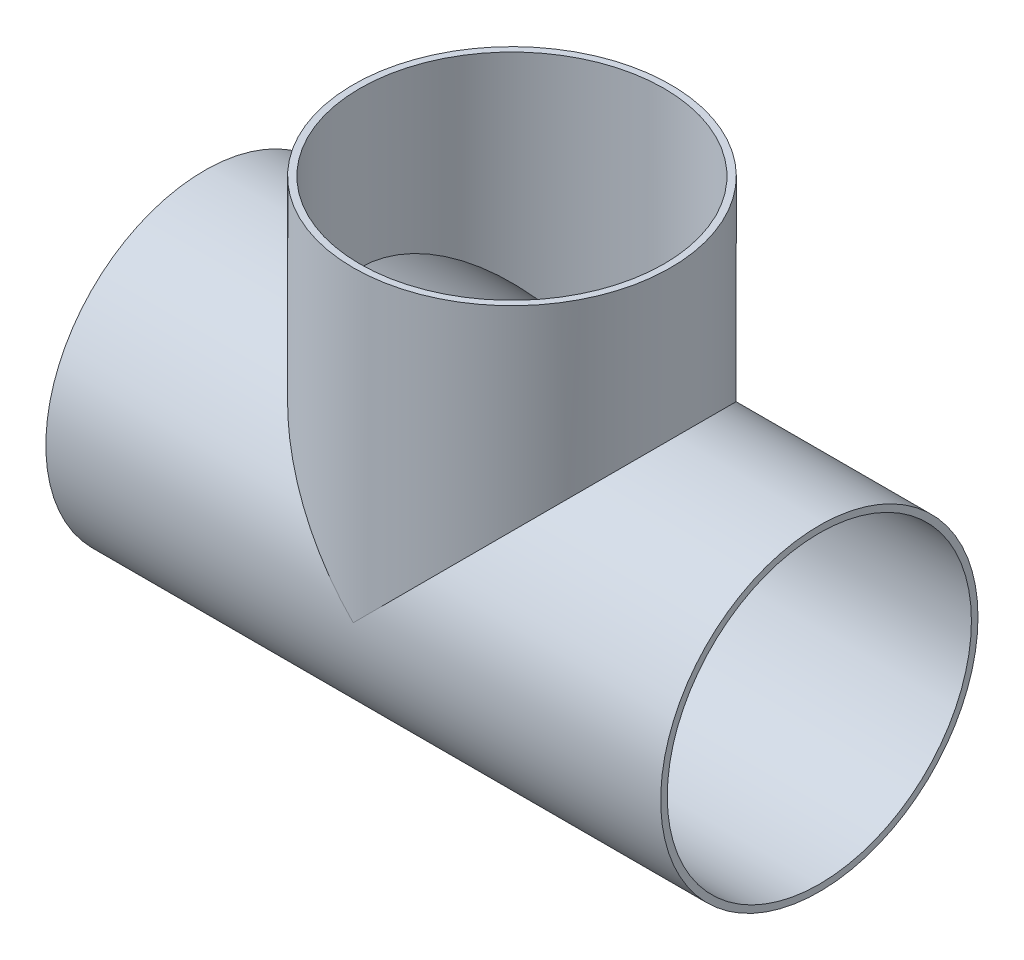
from build123d import *

# Parameters (mm, degrees)
SKETCH1_R           = 50.8
BOSS_EXTRUDE1_DEPTH = 98.425
SKETCH2_R           = 50.8
BOSS_EXTRUDE2_DEPTH = 98.425
SKETCH3_R           = 48.6918
CUT_EXTRUDE1_DEPTH  = 98.425
SKETCH4_R           = 48.6918
CUT_EXTRUDE2_DEPTH  = 98.425


with BuildPart() as part:
    # Sketch1 → Boss-Extrude1 (new, symmetric)
    with BuildSketch(Plane(origin=(0, 0, 0), x_dir=(0, 0, -1), z_dir=(1, 0, 0))):
        Circle(SKETCH1_R)
    extrude(amount=BOSS_EXTRUDE1_DEPTH, both=True)

    # Sketch2 → Boss-Extrude2 (add)
    with BuildSketch(Plane(origin=(0, 0, 0), x_dir=(1, 0, 0), z_dir=(0, 1, 0))):
        with Locations(Location((0, 0, 0), (0, 0, 270))):
            Circle(SKETCH2_R)
    extrude(amount=BOSS_EXTRUDE2_DEPTH)

    # Sketch3 → Cut-Extrude1 (cut)
    with BuildSketch(Plane(origin=(0, 0, 0), x_dir=(1, 0, 0), z_dir=(0, 1, 0))):
        with Locations(Location((0, 0, 0), (0, 0, 270))):
            Circle(SKETCH3_R)
    extrude(amount=CUT_EXTRUDE1_DEPTH, mode=Mode.SUBTRACT)

    # Sketch4 → Cut-Extrude2 (cut, symmetric)
    with BuildSketch(Plane(origin=(0, 0, 0), x_dir=(0, 0, -1), z_dir=(1, 0, 0))):
        Circle(SKETCH4_R)
    extrude(amount=CUT_EXTRUDE2_DEPTH, both=True, mode=Mode.SUBTRACT)


solid = part.part
